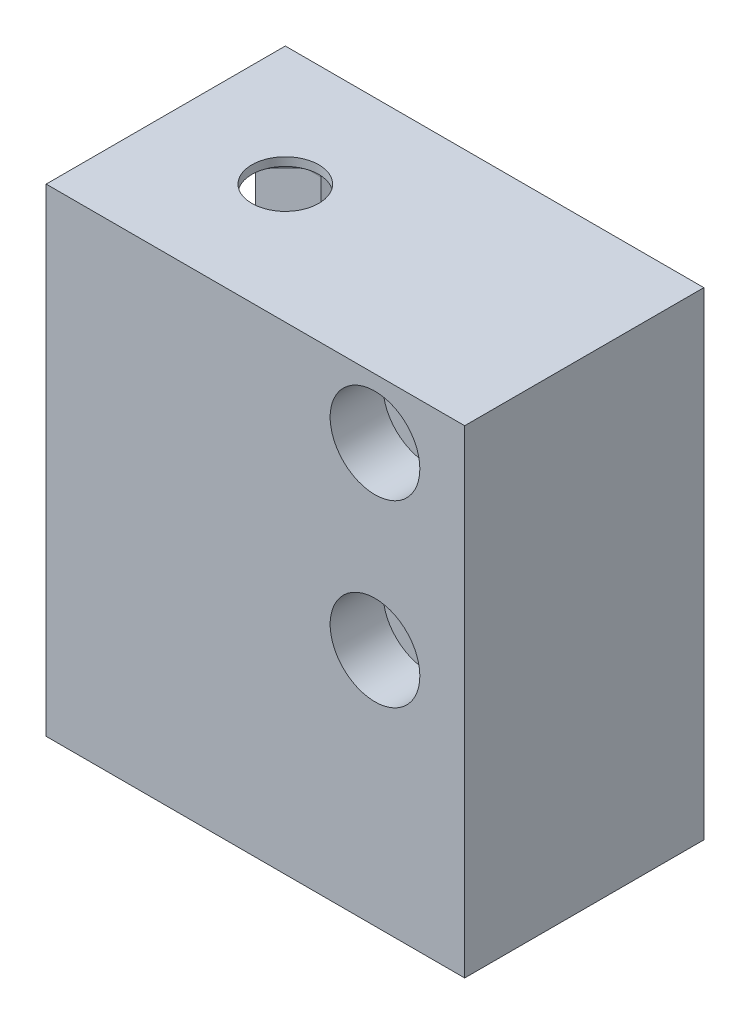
from build123d import *

# Parameters (mm, degrees)
SKETCH1_W                                       = 44.45
SKETCH1_H                                       = 25.4
BOSS_EXTRUDE1_DEPTH                             = 50.8
SKETCH2_R                                       = 4.7625
CUT_EXTRUDE1_DEPTH                              = 3.175
HOLE1_D                                         = 4.826
HOLE1_DEPTH                                     = 14.224
HOLE1_TIP                                       = 1.449876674
SKETCH5_R                                       = 11.1125
CUT_EXTRUDE2_DEPTH                              = 49.911
CUT_EXTRUDE3_REACH                              = 70.686
CUT_EXTRUDE3_END_RADIUS                         = 11.1125
SKETCH6_W                                       = 19.05
SKETCH6_H                                       = 44.45
CBORE_FOR_10_SOCKET_HEAD_CAP_SCREW1_D           = 5.1054
CBORE_FOR_10_SOCKET_HEAD_CAP_SCREW1_DEPTH       = 12.7
CBORE_FOR_10_SOCKET_HEAD_CAP_SCREW1_CBORE_D     = 9.525
CBORE_FOR_10_SOCKET_HEAD_CAP_SCREW1_CBORE_DEPTH = 5.6134
CBORE_FOR_10_SOCKET_HEAD_CAP_SCREW1_TIP         = 1.533816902
CBORE_FOR_10_SOCKET_HEAD_CAP_SCREW2_D           = 5.1054
CBORE_FOR_10_SOCKET_HEAD_CAP_SCREW2_CBORE_D     = 9.525
CBORE_FOR_10_SOCKET_HEAD_CAP_SCREW2_CBORE_DEPTH = 6.40842
SKETCH12_R                                      = 3.556
CUT_EXTRUDE4_DEPTH                              = 57.092321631
FILLET1_R                                       = 0.635


with BuildPart() as part:
    # Sketch1 → Boss-Extrude1 (new body)
    with BuildSketch(Plane(origin=(0, 0, 0), x_dir=(1, 0, 0), z_dir=(0, 1, 0))):
        Rectangle(SKETCH1_W, SKETCH1_H)
    extrude(amount=BOSS_EXTRUDE1_DEPTH)

    # Sketch2 → Cut-Extrude1 (cut)
    with BuildSketch(Plane.XZ):
        with Locations(Location((4.7752, 0, 0), (0, 0, 270))):
            Circle(SKETCH2_R)
    extrude(amount=-CUT_EXTRUDE1_DEPTH, mode=Mode.SUBTRACT)

    # Hole1
    with Locations(Plane.XZ.offset(-3.175)):
        with Locations((4.7752, 0)):
            Hole(HOLE1_D / 2, depth=HOLE1_DEPTH)
            with Locations((0, 0, -(HOLE1_DEPTH + HOLE1_TIP / 2))):  # 118° drill point
                Cone(0, HOLE1_D / 2, HOLE1_TIP, mode=Mode.SUBTRACT)

    # Sketch5 → Cut-Extrude2 (cut)
    with BuildSketch(Plane.XZ):
        with Locations(Location((-9.525, 0, 0), (0, 0, 270))):
            Circle(SKETCH5_R)
    extrude(amount=-CUT_EXTRUDE2_DEPTH, mode=Mode.SUBTRACT)

    # Cut-Extrude3: up to this cylinder (the profile starts outside it)
    cut_extrude3_end = Plane(origin=(-9.525, 22.225, 0), z_dir=(0, -1, 0)) * Cylinder(CUT_EXTRUDE3_END_RADIUS, 164.597, mode=Mode.PRIVATE)
    # Sketch6 → Cut-Extrude3 (cut, up to the surface)
    with BuildSketch(Plane.ZY.offset(22.225), mode=Mode.PRIVATE) as cut_extrude3_sk1:
        with Locations((0, 22.225)):
            Rectangle(SKETCH6_W, SKETCH6_H)
    cut_extrude3_tool1 = extrude(cut_extrude3_sk1.sketch, amount=-CUT_EXTRUDE3_REACH, mode=Mode.PRIVATE) - cut_extrude3_end
    add(cut_extrude3_tool1.solids().sort_by_distance((-22.225, 22.225, 0))[0], mode=Mode.SUBTRACT)

    # CBORE for _10 Socket Head Cap Screw1
    with Locations(Plane.XY.offset(12.7)):
        with Locations((12.7, 25.4), (12.7, 44.45)):
            CounterBoreHole(CBORE_FOR_10_SOCKET_HEAD_CAP_SCREW1_D / 2, CBORE_FOR_10_SOCKET_HEAD_CAP_SCREW1_CBORE_D / 2, CBORE_FOR_10_SOCKET_HEAD_CAP_SCREW1_CBORE_DEPTH, depth=CBORE_FOR_10_SOCKET_HEAD_CAP_SCREW1_DEPTH)
            with Locations((0, 0, -(CBORE_FOR_10_SOCKET_HEAD_CAP_SCREW1_DEPTH + CBORE_FOR_10_SOCKET_HEAD_CAP_SCREW1_TIP / 2))):  # 118° drill point
                Cone(0, CBORE_FOR_10_SOCKET_HEAD_CAP_SCREW1_D / 2, CBORE_FOR_10_SOCKET_HEAD_CAP_SCREW1_TIP, mode=Mode.SUBTRACT)

    # CBORE for _10 Socket Head Cap Screw2 (through all)
    with Locations(Plane(origin=(0, 0, -12.7), x_dir=(-1, 0, 0), z_dir=(0, 0, -1))):
        with Locations((-12.7, 44.45), (-12.7, 25.4)):
            CounterBoreHole(CBORE_FOR_10_SOCKET_HEAD_CAP_SCREW2_D / 2, CBORE_FOR_10_SOCKET_HEAD_CAP_SCREW2_CBORE_D / 2, CBORE_FOR_10_SOCKET_HEAD_CAP_SCREW2_CBORE_DEPTH)

    # Sketch12 → Cut-Extrude4 (cut, through all)
    with BuildSketch(Plane.XZ.offset(-49.911)):
        with Locations(Location((-9.525, 0, 0), (0, 0, 270))):
            Circle(SKETCH12_R)
    extrude(amount=-CUT_EXTRUDE4_DEPTH, mode=Mode.SUBTRACT)

    # Fillet1
    fillet1_edges = [part.edges().sort_by_distance(p)[0] for p in [
        (-9.525, 49.911, 11.1125),
        (-18.736906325, 44.45, 9.525),
        (-18.736906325, 44.45, -9.525),
    ]]
    fillet(fillet1_edges, radius=FILLET1_R)


solid = part.part
